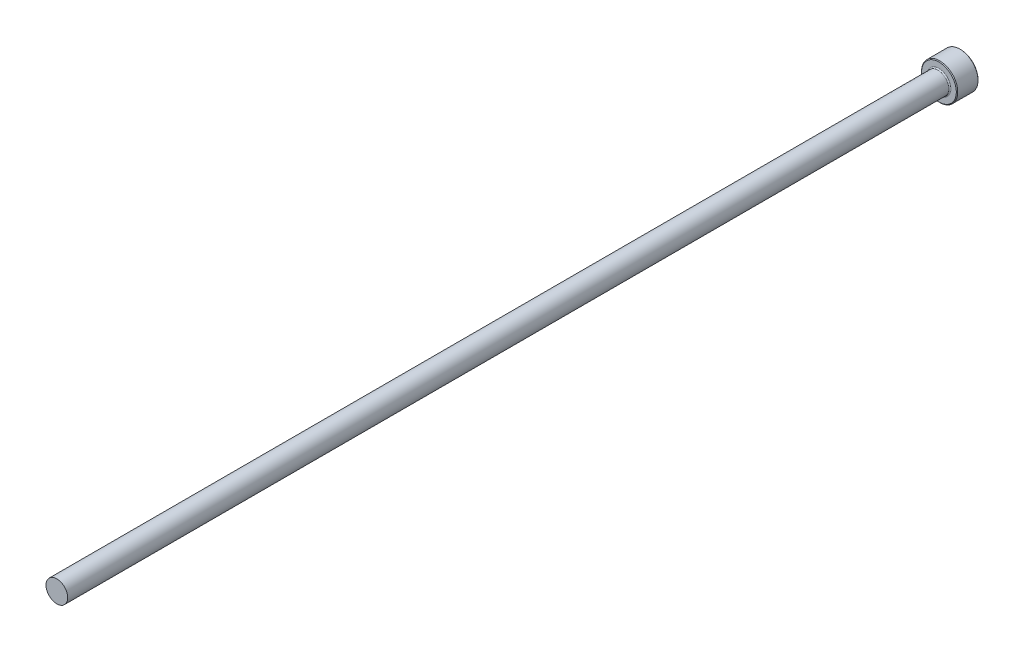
ISO-10303-21;
HEADER;
FILE_DESCRIPTION(('STEP AP214'),'2;1');
FILE_NAME('part.step','',(''),(''),'','','');
FILE_SCHEMA(('AUTOMOTIVE_DESIGN { 1 0 10303 214 1 1 1 1 }'));
ENDSEC;
DATA;
#1=APPLICATION_CONTEXT('core data for automotive mechanical design processes');
#2=APPLICATION_PROTOCOL_DEFINITION('international standard','automotive_design',2000,#1);
#3=PRODUCT_CONTEXT('',#1,'mechanical');
#4=PRODUCT('Part','Part','',(#3));
#5=PRODUCT_RELATED_PRODUCT_CATEGORY('part','',(#4));
#6=PRODUCT_DEFINITION_FORMATION('','',#4);
#7=PRODUCT_DEFINITION_CONTEXT('part definition',#1,'design');
#8=PRODUCT_DEFINITION('design','',#6,#7);
#9=PRODUCT_DEFINITION_SHAPE('','',#8);
#10=(LENGTH_UNIT() NAMED_UNIT(*) SI_UNIT(.MILLI.,.METRE.));
#11=(NAMED_UNIT(*) PLANE_ANGLE_UNIT() SI_UNIT($,.RADIAN.));
#12=(NAMED_UNIT(*) SI_UNIT($,.STERADIAN.) SOLID_ANGLE_UNIT());
#13=UNCERTAINTY_MEASURE_WITH_UNIT(LENGTH_MEASURE(1.E-05),#10,'distance_accuracy_value','');
#14=(GEOMETRIC_REPRESENTATION_CONTEXT(3) GLOBAL_UNCERTAINTY_ASSIGNED_CONTEXT((#13)) GLOBAL_UNIT_ASSIGNED_CONTEXT((#10,
#11,#12)) REPRESENTATION_CONTEXT('',''));
#15=CARTESIAN_POINT('',(0.,0.,0.));
#16=DIRECTION('',(0.,0.,1.));
#17=DIRECTION('',(1.,0.,0.));
#18=AXIS2_PLACEMENT_3D('',#15,#16,#17);
#19=CARTESIAN_POINT('',(0.,2.99999999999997,250.));
#20=DIRECTION('',(0.,0.,-1.));
#21=DIRECTION('',(-1.,0.,0.));
#22=AXIS2_PLACEMENT_3D('',#19,#20,#21);
#23=PLANE('',#22);
#24=CARTESIAN_POINT('',(0.,0.,250.));
#25=DIRECTION('',(0.,0.,1.));
#26=DIRECTION('',(1.,0.,0.));
#27=AXIS2_PLACEMENT_3D('',#24,#25,#26);
#28=CIRCLE('',#27,2.99999999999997);
#29=CARTESIAN_POINT('',(2.99999999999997,0.,250.));
#30=VERTEX_POINT('',#29);
#31=EDGE_CURVE('E50',#30,#30,#28,.T.);
#32=ORIENTED_EDGE('',*,*,#31,.T.);
#33=EDGE_LOOP('',(#32));
#34=FACE_BOUND('',#33,.T.);
#35=ADVANCED_FACE('F30',(#34),#23,.F.);
#36=CARTESIAN_POINT('',(0.,0.,109.050628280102));
#37=DIRECTION('',(0.,0.,1.));
#38=DIRECTION('',(1.,0.,0.));
#39=AXIS2_PLACEMENT_3D('',#36,#37,#38);
#40=CYLINDRICAL_SURFACE('',#39,2.99999999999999);
#41=ORIENTED_EDGE('',*,*,#31,.F.);
#42=EDGE_LOOP('',(#41));
#43=FACE_BOUND('',#42,.T.);
#44=CARTESIAN_POINT('',(0.,0.,6.3));
#45=DIRECTION('',(0.,0.,1.));
#46=DIRECTION('',(1.,0.,0.));
#47=AXIS2_PLACEMENT_3D('',#44,#45,#46);
#48=CIRCLE('',#47,3.);
#49=CARTESIAN_POINT('',(3.,0.,6.3));
#50=VERTEX_POINT('',#49);
#51=EDGE_CURVE('E53',#50,#50,#48,.T.);
#52=ORIENTED_EDGE('',*,*,#51,.T.);
#53=EDGE_LOOP('',(#52));
#54=FACE_BOUND('',#53,.T.);
#55=ADVANCED_FACE('F73',(#43,#54),#40,.T.);
#56=CARTESIAN_POINT('',(0.,0.,6.3));
#57=DIRECTION('',(0.,0.,1.));
#58=DIRECTION('',(1.,0.,0.));
#59=AXIS2_PLACEMENT_3D('',#56,#57,#58);
#60=TOROIDAL_SURFACE('',#59,3.3,0.3);
#61=ORIENTED_EDGE('',*,*,#51,.F.);
#62=EDGE_LOOP('',(#61));
#63=FACE_BOUND('',#62,.T.);
#64=CARTESIAN_POINT('',(0.,0.,6.00000000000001));
#65=DIRECTION('',(0.,0.,1.));
#66=DIRECTION('',(1.,0.,0.));
#67=AXIS2_PLACEMENT_3D('',#64,#65,#66);
#68=CIRCLE('',#67,3.3);
#69=CARTESIAN_POINT('',(3.3,0.,6.00000000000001));
#70=VERTEX_POINT('',#69);
#71=EDGE_CURVE('E56',#70,#70,#68,.T.);
#72=ORIENTED_EDGE('',*,*,#71,.T.);
#73=EDGE_LOOP('',(#72));
#74=FACE_BOUND('',#73,.T.);
#75=ADVANCED_FACE('F60',(#63,#74),#60,.F.);
#76=CARTESIAN_POINT('',(0.,5.,6.));
#77=DIRECTION('',(0.,0.,-1.));
#78=DIRECTION('',(-1.,0.,0.));
#79=AXIS2_PLACEMENT_3D('',#76,#77,#78);
#80=PLANE('',#79);
#81=CARTESIAN_POINT('',(0.,0.,6.));
#82=DIRECTION('',(0.,0.,-1.));
#83=DIRECTION('',(-1.,0.,0.));
#84=AXIS2_PLACEMENT_3D('',#81,#82,#83);
#85=CIRCLE('',#84,4.79999999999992);
#86=CARTESIAN_POINT('',(-4.79999999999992,0.,6.));
#87=VERTEX_POINT('',#86);
#88=EDGE_CURVE('E10',#87,#87,#85,.F.);
#89=ORIENTED_EDGE('',*,*,#88,.T.);
#90=EDGE_LOOP('',(#89));
#91=FACE_BOUND('',#90,.T.);
#92=ORIENTED_EDGE('',*,*,#71,.F.);
#93=EDGE_LOOP('',(#92));
#94=FACE_BOUND('',#93,.T.);
#95=ADVANCED_FACE('F62',(#91,#94),#80,.F.);
#96=CARTESIAN_POINT('',(0.,0.,109.050628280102));
#97=DIRECTION('',(0.,0.,1.));
#98=DIRECTION('',(1.,0.,0.));
#99=AXIS2_PLACEMENT_3D('',#96,#97,#98);
#100=CYLINDRICAL_SURFACE('',#99,5.);
#101=CARTESIAN_POINT('',(0.,0.,0.200000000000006));
#102=DIRECTION('',(0.,0.,1.));
#103=DIRECTION('',(1.,0.,0.));
#104=AXIS2_PLACEMENT_3D('',#101,#102,#103);
#105=CIRCLE('',#104,5.);
#106=CARTESIAN_POINT('',(5.,0.,0.200000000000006));
#107=VERTEX_POINT('',#106);
#108=EDGE_CURVE('E41',#107,#107,#105,.T.);
#109=ORIENTED_EDGE('',*,*,#108,.T.);
#110=EDGE_LOOP('',(#109));
#111=FACE_BOUND('',#110,.T.);
#112=CARTESIAN_POINT('',(0.,0.,5.79999999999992));
#113=DIRECTION('',(0.,0.,-1.));
#114=DIRECTION('',(-1.,0.,0.));
#115=AXIS2_PLACEMENT_3D('',#112,#113,#114);
#116=CIRCLE('',#115,5.);
#117=CARTESIAN_POINT('',(-5.,0.,5.79999999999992));
#118=VERTEX_POINT('',#117);
#119=EDGE_CURVE('E45',#118,#118,#116,.T.);
#120=ORIENTED_EDGE('',*,*,#119,.T.);
#121=EDGE_LOOP('',(#120));
#122=FACE_BOUND('',#121,.T.);
#123=ADVANCED_FACE('F64',(#111,#122),#100,.T.);
#124=CARTESIAN_POINT('',(0.,0.,0.));
#125=DIRECTION('',(0.,0.,1.));
#126=DIRECTION('',(1.,0.,0.));
#127=AXIS2_PLACEMENT_3D('',#124,#125,#126);
#128=PLANE('',#127);
#129=CARTESIAN_POINT('',(0.,0.,0.));
#130=DIRECTION('',(0.,0.,1.));
#131=DIRECTION('',(1.,0.,0.));
#132=AXIS2_PLACEMENT_3D('',#129,#130,#131);
#133=CIRCLE('',#132,4.8);
#134=CARTESIAN_POINT('',(4.8,0.,0.));
#135=VERTEX_POINT('',#134);
#136=EDGE_CURVE('E37',#135,#135,#133,.F.);
#137=ORIENTED_EDGE('',*,*,#136,.T.);
#138=EDGE_LOOP('',(#137));
#139=FACE_BOUND('',#138,.T.);
#140=ADVANCED_FACE('F70',(#139),#128,.F.);
#141=CARTESIAN_POINT('',(0.,0.,0.200000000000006));
#142=DIRECTION('',(0.,0.,1.));
#143=DIRECTION('',(1.,0.,0.));
#144=AXIS2_PLACEMENT_3D('',#141,#142,#143);
#145=CONICAL_SURFACE('',#144,5.,0.785398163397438);
#146=ORIENTED_EDGE('',*,*,#136,.F.);
#147=EDGE_LOOP('',(#146));
#148=FACE_BOUND('',#147,.T.);
#149=ORIENTED_EDGE('',*,*,#108,.F.);
#150=EDGE_LOOP('',(#149));
#151=FACE_BOUND('',#150,.T.);
#152=ADVANCED_FACE('F84',(#148,#151),#145,.T.);
#153=CARTESIAN_POINT('',(0.,0.,6.00000000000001));
#154=DIRECTION('',(0.,0.,-1.));
#155=DIRECTION('',(-1.,0.,0.));
#156=AXIS2_PLACEMENT_3D('',#153,#154,#155);
#157=CONICAL_SURFACE('',#156,4.79999999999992,0.785398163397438);
#158=ORIENTED_EDGE('',*,*,#119,.F.);
#159=EDGE_LOOP('',(#158));
#160=FACE_BOUND('',#159,.T.);
#161=ORIENTED_EDGE('',*,*,#88,.F.);
#162=EDGE_LOOP('',(#161));
#163=FACE_BOUND('',#162,.T.);
#164=ADVANCED_FACE('F32',(#160,#163),#157,.T.);
#165=CLOSED_SHELL('',(#35,#55,#75,#95,#123,#140,#152,#164));
#166=MANIFOLD_SOLID_BREP('B2',#165);
#167=ADVANCED_BREP_SHAPE_REPRESENTATION('',(#18,#166),#14);
#168=SHAPE_DEFINITION_REPRESENTATION(#9,#167);
ENDSEC;
END-ISO-10303-21;
